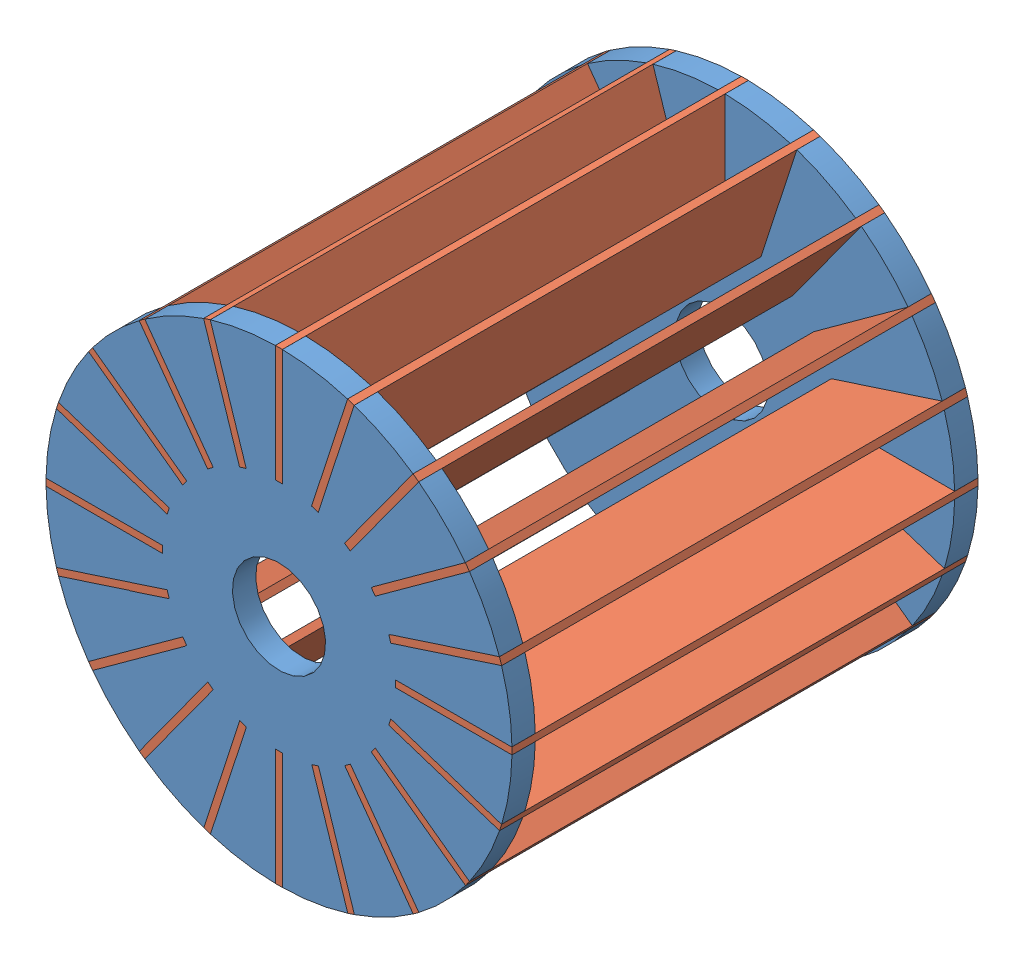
SolidWorks assembly Assem1.sldasm, configuration Default (file format 8000). Lengths in mm.
Overall size (251.99 251.99 200).
22 component instances, 2 part files, 4 mates.
Components (placement in the parent):
- mold wheel-1: mold wheel.SLDPRT [Default] at (120.1811 130.616 106.6352) size (199.98 199.98 10)
- strip-1: strip.SLDPRT [Default] at (181.7096 173.5268 206.6352) x (0.809017 0.587785 0) z (-0.587785 0.809017 0) size (50 200 3)
- mold wheel-2: mold wheel.SLDPRT [Default] at (120.1811 130.616 296.6352) x (0.951057 0.309017 0) z (0 0 1) size (199.98 199.98 10)
- strip-59: strip.SLDPRT [Default] at (165.438 190.44 206.6352) x (0.587785 0.809017 0) z (-0.809017 0.587785 0) size (50 200 3)
- strip-60: strip.SLDPRT [Default] at (144.7364 201.4972 206.6352) x (0.309017 0.951057 0) z (-0.951057 0.309017 0) size (50 200 3)
- strip-61: strip.SLDPRT [Default] at (121.6311 205.616 206.6352) x (0 1 0) z (-1 0 0) size (50 200 3)
- strip-62: strip.SLDPRT [Default] at (98.3838 202.3933 206.6352) x (-0.309017 0.951057 0) z (-0.951057 -0.309017 0) size (50 200 3)
- strip-63: strip.SLDPRT [Default] at (77.2702 192.1446 206.6352) x (-0.587785 0.809017 0) z (-0.809017 -0.587785 0) size (50 200 3)
- strip-64: strip.SLDPRT [Default] at (60.3571 175.873 206.6352) x (-0.809017 0.587785 0) z (-0.587785 -0.809017 0) size (50 200 3)
- strip-65: strip.SLDPRT [Default] at (49.2999 155.1713 206.6352) x (-0.951057 0.309017 0) z (-0.309017 -0.951057 0) size (50 200 3)
- strip-66: strip.SLDPRT [Default] at (45.1811 132.066 206.6352) x (-1 0 0) z (0 -1 0) size (50 200 3)
- strip-67: strip.SLDPRT [Default] at (48.4038 108.8187 206.6352) x (-0.951057 -0.309017 0) z (0.309017 -0.951057 0) size (50 200 3)
- strip-68: strip.SLDPRT [Default] at (58.6525 87.7052 206.6352) x (-0.809017 -0.587785 0) z (0.587785 -0.809017 0) size (50 200 3)
- strip-69: strip.SLDPRT [Default] at (74.9241 70.792 206.6352) x (-0.587785 -0.809017 0) z (0.809017 -0.587785 0) size (50 200 3)
- strip-70: strip.SLDPRT [Default] at (95.6258 59.7348 206.6352) x (-0.309017 -0.951057 0) z (0.951057 -0.309017 0) size (50 200 3)
- strip-71: strip.SLDPRT [Default] at (118.7311 55.616 206.6352) x (0 -1 0) z (1 0 0) size (50 200 3)
- strip-72: strip.SLDPRT [Default] at (141.9783 58.8387 206.6352) x (0.309017 -0.951057 0) z (0.951057 0.309017 0) size (50 200 3)
- strip-73: strip.SLDPRT [Default] at (163.0919 69.0874 206.6352) x (0.587785 -0.809017 0) z (0.809017 0.587785 0) size (50 200 3)
- strip-74: strip.SLDPRT [Default] at (180.005 85.359 206.6352) x (0.809017 -0.587785 0) z (0.587785 0.809017 0) size (50 200 3)
- strip-75: strip.SLDPRT [Default] at (191.0622 106.0607 206.6352) x (0.951057 -0.309017 0) z (0.309017 0.951057 0) size (50 200 3)
- strip-76: strip.SLDPRT [Default] at (195.1811 129.166 206.6352) x (1 0 0) z (0 1 0) size (50 200 3)
- strip-77: strip.SLDPRT [Default] at (191.9584 152.4132 206.6352) x (0.951057 0.309017 0) z (-0.309017 0.951057 0) size (50 200 3)
Mates (geometry in assembly coordinates):
- Concentric1: concentric aligned: cylinder of mold wheel-1 through (120.1811 130.616 116.6352) axis (0 0 -1) radius 20; cylinder of mold wheel-2 through (120.1811 130.616 306.6352) axis (0 0 -1) radius 20
- Coincident15: coincident anti-aligned: line of mold wheel-1 through (161.4842 158.8322 106.6352) axis (0.809017 0.587785 0); line of strip-1 through (201.9351 188.2214 106.6352) axis (-0.809017 -0.587785 0)
- Coincident16: coincident anti-aligned: line of mold wheel-1 through (161.4842 158.8322 106.6352) axis (-0.587785 0.809017 0); line of strip-1 through (159.7208 161.2592 106.6352) axis (0.587785 -0.809017 0)
- Distance2: distance = 180 mm anti-aligned: plane of mold wheel-1 through (120.1811 130.616 116.6352) normal (0 0 1); plane of mold wheel-2 through (120.1811 130.616 296.6352) normal (0 0 -1)
